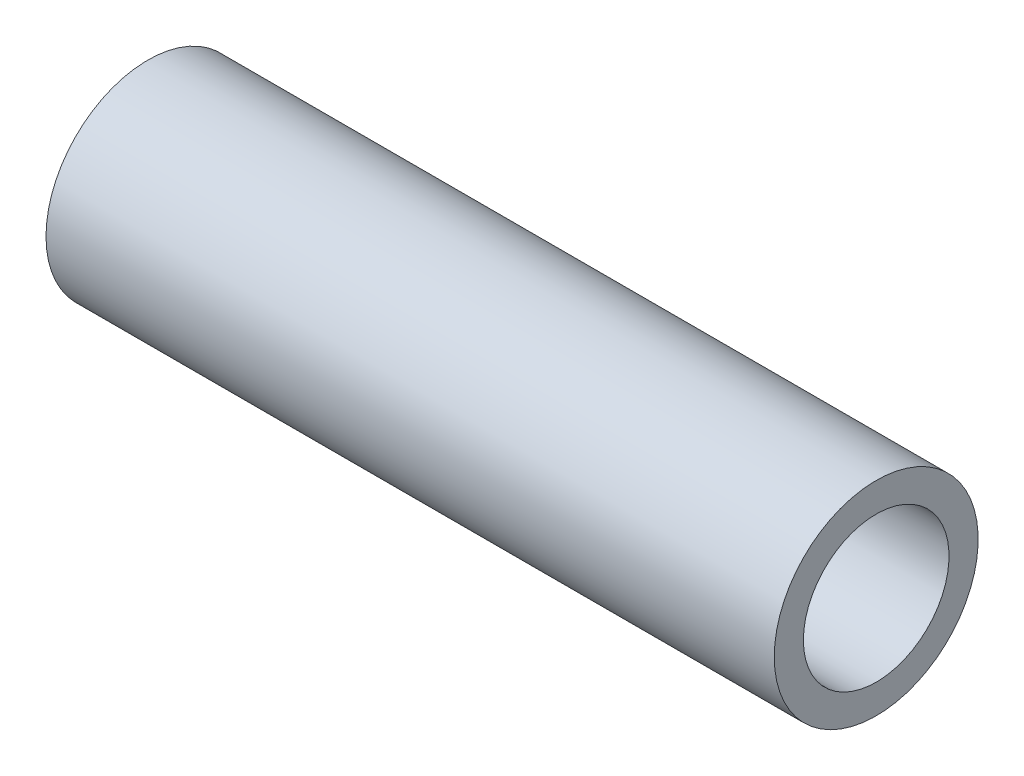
ISO-10303-21;
HEADER;
FILE_DESCRIPTION(('STEP AP214'),'2;1');
FILE_NAME('part.step','',(''),(''),'','','');
FILE_SCHEMA(('AUTOMOTIVE_DESIGN { 1 0 10303 214 1 1 1 1 }'));
ENDSEC;
DATA;
#1=APPLICATION_CONTEXT('core data for automotive mechanical design processes');
#2=APPLICATION_PROTOCOL_DEFINITION('international standard','automotive_design',2000,#1);
#3=PRODUCT_CONTEXT('',#1,'mechanical');
#4=PRODUCT('Part','Part','',(#3));
#5=PRODUCT_RELATED_PRODUCT_CATEGORY('part','',(#4));
#6=PRODUCT_DEFINITION_FORMATION('','',#4);
#7=PRODUCT_DEFINITION_CONTEXT('part definition',#1,'design');
#8=PRODUCT_DEFINITION('design','',#6,#7);
#9=PRODUCT_DEFINITION_SHAPE('','',#8);
#10=(LENGTH_UNIT() NAMED_UNIT(*) SI_UNIT(.MILLI.,.METRE.));
#11=(NAMED_UNIT(*) PLANE_ANGLE_UNIT() SI_UNIT($,.RADIAN.));
#12=(NAMED_UNIT(*) SI_UNIT($,.STERADIAN.) SOLID_ANGLE_UNIT());
#13=UNCERTAINTY_MEASURE_WITH_UNIT(LENGTH_MEASURE(1.E-05),#10,'distance_accuracy_value','');
#14=(GEOMETRIC_REPRESENTATION_CONTEXT(3) GLOBAL_UNCERTAINTY_ASSIGNED_CONTEXT((#13)) GLOBAL_UNIT_ASSIGNED_CONTEXT((#10,
#11,#12)) REPRESENTATION_CONTEXT('',''));
#15=CARTESIAN_POINT('',(0.,0.,0.));
#16=DIRECTION('',(0.,0.,1.));
#17=DIRECTION('',(1.,0.,0.));
#18=AXIS2_PLACEMENT_3D('',#15,#16,#17);
#19=CARTESIAN_POINT('',(76.2,0.,0.));
#20=DIRECTION('',(-1.,0.,0.));
#21=DIRECTION('',(0.,0.,1.));
#22=AXIS2_PLACEMENT_3D('',#19,#20,#21);
#23=CYLINDRICAL_SURFACE('',#22,7.62);
#24=CARTESIAN_POINT('',(76.2,0.,0.));
#25=DIRECTION('',(1.,0.,0.));
#26=DIRECTION('',(0.,0.,-1.));
#27=AXIS2_PLACEMENT_3D('',#24,#25,#26);
#28=CIRCLE('',#27,7.62);
#29=CARTESIAN_POINT('',(76.2,0.,7.62));
#30=VERTEX_POINT('',#29);
#31=EDGE_CURVE('E48',#30,#30,#28,.T.);
#32=CARTESIAN_POINT('',(0.,0.,0.));
#33=DIRECTION('',(1.,0.,0.));
#34=DIRECTION('',(0.,0.,-1.));
#35=AXIS2_PLACEMENT_3D('',#32,#33,#34);
#36=CIRCLE('',#35,7.62);
#37=CARTESIAN_POINT('',(0.,0.,7.62));
#38=VERTEX_POINT('',#37);
#39=EDGE_CURVE('E55',#38,#38,#36,.T.);
#40=CARTESIAN_POINT('',(76.2,0.,7.62));
#41=CARTESIAN_POINT('',(75.40625,0.,7.62));
#42=CARTESIAN_POINT('',(74.6125,0.,7.62));
#43=CARTESIAN_POINT('',(73.025,0.,7.62));
#44=CARTESIAN_POINT('',(72.23125,0.,7.62));
#45=CARTESIAN_POINT('',(70.64375,0.,7.62));
#46=CARTESIAN_POINT('',(69.85,0.,7.62));
#47=CARTESIAN_POINT('',(68.2625,0.,7.62));
#48=CARTESIAN_POINT('',(67.46875,0.,7.62));
#49=CARTESIAN_POINT('',(65.88125,0.,7.62));
#50=CARTESIAN_POINT('',(65.0875,0.,7.62));
#51=CARTESIAN_POINT('',(63.5,0.,7.62));
#52=CARTESIAN_POINT('',(62.70625,0.,7.62));
#53=CARTESIAN_POINT('',(61.11875,0.,7.62));
#54=CARTESIAN_POINT('',(60.325,0.,7.62));
#55=CARTESIAN_POINT('',(58.7375,0.,7.62));
#56=CARTESIAN_POINT('',(57.94375,0.,7.62));
#57=CARTESIAN_POINT('',(56.35625,0.,7.62));
#58=CARTESIAN_POINT('',(55.5625,0.,7.62));
#59=CARTESIAN_POINT('',(53.975,0.,7.62));
#60=CARTESIAN_POINT('',(53.18125,0.,7.62));
#61=CARTESIAN_POINT('',(51.59375,0.,7.62));
#62=CARTESIAN_POINT('',(50.8,0.,7.62));
#63=CARTESIAN_POINT('',(49.2125,0.,7.62));
#64=CARTESIAN_POINT('',(48.41875,0.,7.62));
#65=CARTESIAN_POINT('',(46.83125,0.,7.62));
#66=CARTESIAN_POINT('',(46.0375,0.,7.62));
#67=CARTESIAN_POINT('',(44.45,0.,7.62));
#68=CARTESIAN_POINT('',(43.65625,0.,7.62));
#69=CARTESIAN_POINT('',(42.06875,0.,7.62));
#70=CARTESIAN_POINT('',(41.275,0.,7.62));
#71=CARTESIAN_POINT('',(39.6875,0.,7.62));
#72=CARTESIAN_POINT('',(38.89375,0.,7.62));
#73=CARTESIAN_POINT('',(37.30625,0.,7.62));
#74=CARTESIAN_POINT('',(36.5125,0.,7.62));
#75=CARTESIAN_POINT('',(34.925,0.,7.62));
#76=CARTESIAN_POINT('',(34.13125,0.,7.62));
#77=CARTESIAN_POINT('',(32.54375,0.,7.62));
#78=CARTESIAN_POINT('',(31.75,0.,7.62));
#79=CARTESIAN_POINT('',(30.1625,0.,7.62));
#80=CARTESIAN_POINT('',(29.36875,0.,7.62));
#81=CARTESIAN_POINT('',(27.78125,0.,7.62));
#82=CARTESIAN_POINT('',(26.9875,0.,7.62));
#83=CARTESIAN_POINT('',(25.4,0.,7.62));
#84=CARTESIAN_POINT('',(24.60625,0.,7.62));
#85=CARTESIAN_POINT('',(23.01875,0.,7.62));
#86=CARTESIAN_POINT('',(22.225,0.,7.62));
#87=CARTESIAN_POINT('',(20.6375,0.,7.62));
#88=CARTESIAN_POINT('',(19.84375,0.,7.62));
#89=CARTESIAN_POINT('',(18.25625,0.,7.62));
#90=CARTESIAN_POINT('',(17.4625,0.,7.62));
#91=CARTESIAN_POINT('',(15.875,0.,7.62));
#92=CARTESIAN_POINT('',(15.08125,0.,7.62));
#93=CARTESIAN_POINT('',(13.49375,0.,7.62));
#94=CARTESIAN_POINT('',(12.7,0.,7.62));
#95=CARTESIAN_POINT('',(11.1125,0.,7.62));
#96=CARTESIAN_POINT('',(10.31875,0.,7.62));
#97=CARTESIAN_POINT('',(8.73125,0.,7.62));
#98=CARTESIAN_POINT('',(7.93750000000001,0.,7.62));
#99=CARTESIAN_POINT('',(6.35,0.,7.62));
#100=CARTESIAN_POINT('',(5.55625,0.,7.62));
#101=CARTESIAN_POINT('',(3.96875,0.,7.62));
#102=CARTESIAN_POINT('',(3.175,0.,7.62));
#103=CARTESIAN_POINT('',(1.5875,0.,7.62));
#104=CARTESIAN_POINT('',(0.793750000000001,0.,7.62));
#105=CARTESIAN_POINT('',(0.,0.,7.62));
#106=B_SPLINE_CURVE_WITH_KNOTS('',3,(#40,#41,#42,#43,#44,#45,#46,#47,#48,#49,#50,#51,#52,#53,
#54,#55,#56,#57,#58,#59,#60,#61,#62,#63,#64,#65,#66,#67,#68,#69,#70,#71,#72,#73,#74,#75,#76,#77,
#78,#79,#80,#81,#82,#83,#84,#85,#86,#87,#88,#89,#90,#91,#92,#93,#94,#95,#96,#97,#98,#99,#100,
#101,#102,#103,#104,#105),.UNSPECIFIED.,.F.,.F.,(4,2,2,2,2,2,2,2,2,2,2,2,2,2,2,2,2,2,2,2,2,2,2,
2,2,2,2,2,2,2,2,2,4),(0.,2.38125,4.7625,7.14375,9.52500000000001,11.90625,14.2875,16.66875,
19.05,21.43125,23.8125,26.19375,28.575,30.95625,33.3375,35.71875,38.1,40.48125,42.8625,45.24375,
47.625,50.00625,52.3875,54.76875,57.15,59.53125,61.9125,64.29375,66.675,69.05625,71.4375,
73.81875,76.2),.UNSPECIFIED.);
#107=EDGE_CURVE('BSEAM40',#30,#38,#106,.T.);
#108=ORIENTED_EDGE('',*,*,#31,.T.);
#109=ORIENTED_EDGE('',*,*,#39,.F.);
#110=ORIENTED_EDGE('',*,*,#107,.T.);
#111=ORIENTED_EDGE('',*,*,#107,.F.);
#112=EDGE_LOOP('',(#108,#110,#109,#111));
#113=FACE_BOUND('',#112,.T.);
#114=ADVANCED_FACE('F40',(#113),#23,.F.);
#115=CARTESIAN_POINT('',(76.2,0.,0.));
#116=DIRECTION('',(-1.,0.,0.));
#117=DIRECTION('',(0.,0.,1.));
#118=AXIS2_PLACEMENT_3D('',#115,#116,#117);
#119=CYLINDRICAL_SURFACE('',#118,10.668);
#120=CARTESIAN_POINT('',(76.2,0.,0.));
#121=DIRECTION('',(1.,0.,0.));
#122=DIRECTION('',(0.,0.,-1.));
#123=AXIS2_PLACEMENT_3D('',#120,#121,#122);
#124=CIRCLE('',#123,10.668);
#125=CARTESIAN_POINT('',(76.2,0.,10.668));
#126=VERTEX_POINT('',#125);
#127=EDGE_CURVE('E10',#126,#126,#124,.T.);
#128=CARTESIAN_POINT('',(0.,0.,0.));
#129=DIRECTION('',(1.,0.,0.));
#130=DIRECTION('',(0.,0.,-1.));
#131=AXIS2_PLACEMENT_3D('',#128,#129,#130);
#132=CIRCLE('',#131,10.668);
#133=CARTESIAN_POINT('',(0.,0.,10.668));
#134=VERTEX_POINT('',#133);
#135=EDGE_CURVE('E43',#134,#134,#132,.T.);
#136=CARTESIAN_POINT('',(76.2,0.,10.668));
#137=CARTESIAN_POINT('',(75.40625,0.,10.668));
#138=CARTESIAN_POINT('',(74.6125,0.,10.668));
#139=CARTESIAN_POINT('',(73.025,0.,10.668));
#140=CARTESIAN_POINT('',(72.23125,0.,10.668));
#141=CARTESIAN_POINT('',(70.64375,0.,10.668));
#142=CARTESIAN_POINT('',(69.85,0.,10.668));
#143=CARTESIAN_POINT('',(68.2625,0.,10.668));
#144=CARTESIAN_POINT('',(67.46875,0.,10.668));
#145=CARTESIAN_POINT('',(65.88125,0.,10.668));
#146=CARTESIAN_POINT('',(65.0875,0.,10.668));
#147=CARTESIAN_POINT('',(63.5,0.,10.668));
#148=CARTESIAN_POINT('',(62.70625,0.,10.668));
#149=CARTESIAN_POINT('',(61.11875,0.,10.668));
#150=CARTESIAN_POINT('',(60.325,0.,10.668));
#151=CARTESIAN_POINT('',(58.7375,0.,10.668));
#152=CARTESIAN_POINT('',(57.94375,0.,10.668));
#153=CARTESIAN_POINT('',(56.35625,0.,10.668));
#154=CARTESIAN_POINT('',(55.5625,0.,10.668));
#155=CARTESIAN_POINT('',(53.975,0.,10.668));
#156=CARTESIAN_POINT('',(53.18125,0.,10.668));
#157=CARTESIAN_POINT('',(51.59375,0.,10.668));
#158=CARTESIAN_POINT('',(50.8,0.,10.668));
#159=CARTESIAN_POINT('',(49.2125,0.,10.668));
#160=CARTESIAN_POINT('',(48.41875,0.,10.668));
#161=CARTESIAN_POINT('',(46.83125,0.,10.668));
#162=CARTESIAN_POINT('',(46.0375,0.,10.668));
#163=CARTESIAN_POINT('',(44.45,0.,10.668));
#164=CARTESIAN_POINT('',(43.65625,0.,10.668));
#165=CARTESIAN_POINT('',(42.06875,0.,10.668));
#166=CARTESIAN_POINT('',(41.275,0.,10.668));
#167=CARTESIAN_POINT('',(39.6875,0.,10.668));
#168=CARTESIAN_POINT('',(38.89375,0.,10.668));
#169=CARTESIAN_POINT('',(37.30625,0.,10.668));
#170=CARTESIAN_POINT('',(36.5125,0.,10.668));
#171=CARTESIAN_POINT('',(34.925,0.,10.668));
#172=CARTESIAN_POINT('',(34.13125,0.,10.668));
#173=CARTESIAN_POINT('',(32.54375,0.,10.668));
#174=CARTESIAN_POINT('',(31.75,0.,10.668));
#175=CARTESIAN_POINT('',(30.1625,0.,10.668));
#176=CARTESIAN_POINT('',(29.36875,0.,10.668));
#177=CARTESIAN_POINT('',(27.78125,0.,10.668));
#178=CARTESIAN_POINT('',(26.9875,0.,10.668));
#179=CARTESIAN_POINT('',(25.4,0.,10.668));
#180=CARTESIAN_POINT('',(24.60625,0.,10.668));
#181=CARTESIAN_POINT('',(23.01875,0.,10.668));
#182=CARTESIAN_POINT('',(22.225,0.,10.668));
#183=CARTESIAN_POINT('',(20.6375,0.,10.668));
#184=CARTESIAN_POINT('',(19.84375,0.,10.668));
#185=CARTESIAN_POINT('',(18.25625,0.,10.668));
#186=CARTESIAN_POINT('',(17.4625,0.,10.668));
#187=CARTESIAN_POINT('',(15.875,0.,10.668));
#188=CARTESIAN_POINT('',(15.08125,0.,10.668));
#189=CARTESIAN_POINT('',(13.49375,0.,10.668));
#190=CARTESIAN_POINT('',(12.7,0.,10.668));
#191=CARTESIAN_POINT('',(11.1125,0.,10.668));
#192=CARTESIAN_POINT('',(10.31875,0.,10.668));
#193=CARTESIAN_POINT('',(8.73125,0.,10.668));
#194=CARTESIAN_POINT('',(7.93750000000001,0.,10.668));
#195=CARTESIAN_POINT('',(6.35,0.,10.668));
#196=CARTESIAN_POINT('',(5.55625,0.,10.668));
#197=CARTESIAN_POINT('',(3.96875,0.,10.668));
#198=CARTESIAN_POINT('',(3.175,0.,10.668));
#199=CARTESIAN_POINT('',(1.5875,0.,10.668));
#200=CARTESIAN_POINT('',(0.793750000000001,0.,10.668));
#201=CARTESIAN_POINT('',(0.,0.,10.668));
#202=B_SPLINE_CURVE_WITH_KNOTS('',3,(#136,#137,#138,#139,#140,#141,#142,#143,#144,#145,#146,
#147,#148,#149,#150,#151,#152,#153,#154,#155,#156,#157,#158,#159,#160,#161,#162,#163,#164,#165,
#166,#167,#168,#169,#170,#171,#172,#173,#174,#175,#176,#177,#178,#179,#180,#181,#182,#183,#184,
#185,#186,#187,#188,#189,#190,#191,#192,#193,#194,#195,#196,#197,#198,#199,#200,#201),
.UNSPECIFIED.,.F.,.F.,(4,2,2,2,2,2,2,2,2,2,2,2,2,2,2,2,2,2,2,2,2,2,2,2,2,2,2,2,2,2,2,2,4),(0.,
2.38125,4.7625,7.14375,9.52500000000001,11.90625,14.2875,16.66875,19.05,21.43125,23.8125,
26.19375,28.575,30.95625,33.3375,35.71875,38.1,40.48125,42.8625,45.24375,47.625,50.00625,
52.3875,54.76875,57.15,59.53125,61.9125,64.29375,66.675,69.05625,71.4375,73.81875,76.2),.UNSPECIFIED.);
#203=EDGE_CURVE('BSEAM64',#126,#134,#202,.T.);
#204=ORIENTED_EDGE('',*,*,#127,.F.);
#205=ORIENTED_EDGE('',*,*,#135,.T.);
#206=ORIENTED_EDGE('',*,*,#203,.T.);
#207=ORIENTED_EDGE('',*,*,#203,.F.);
#208=EDGE_LOOP('',(#204,#206,#205,#207));
#209=FACE_BOUND('',#208,.T.);
#210=ADVANCED_FACE('F64',(#209),#119,.T.);
#211=CARTESIAN_POINT('',(76.2,0.,0.));
#212=DIRECTION('',(1.,0.,0.));
#213=DIRECTION('',(0.,0.,-1.));
#214=AXIS2_PLACEMENT_3D('',#211,#212,#213);
#215=PLANE('',#214);
#216=ORIENTED_EDGE('',*,*,#31,.F.);
#217=EDGE_LOOP('',(#216));
#218=FACE_BOUND('',#217,.T.);
#219=ORIENTED_EDGE('',*,*,#127,.T.);
#220=EDGE_LOOP('',(#219));
#221=FACE_BOUND('',#220,.T.);
#222=ADVANCED_FACE('F68',(#218,#221),#215,.T.);
#223=CARTESIAN_POINT('',(0.,0.,0.));
#224=DIRECTION('',(1.,0.,0.));
#225=DIRECTION('',(0.,0.,-1.));
#226=AXIS2_PLACEMENT_3D('',#223,#224,#225);
#227=PLANE('',#226);
#228=ORIENTED_EDGE('',*,*,#39,.T.);
#229=EDGE_LOOP('',(#228));
#230=FACE_BOUND('',#229,.T.);
#231=ORIENTED_EDGE('',*,*,#135,.F.);
#232=EDGE_LOOP('',(#231));
#233=FACE_BOUND('',#232,.T.);
#234=ADVANCED_FACE('F66',(#230,#233),#227,.F.);
#235=CLOSED_SHELL('',(#114,#210,#222,#234));
#236=MANIFOLD_SOLID_BREP('B2',#235);
#237=ADVANCED_BREP_SHAPE_REPRESENTATION('',(#18,#236),#14);
#238=SHAPE_DEFINITION_REPRESENTATION(#9,#237);
ENDSEC;
END-ISO-10303-21;
